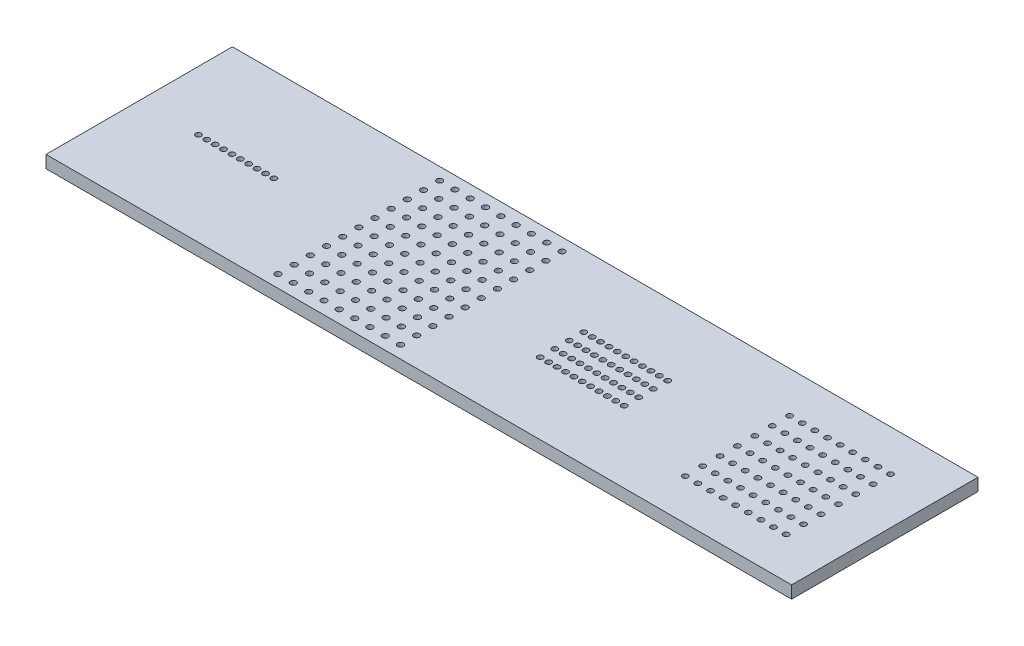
from build123d import *

# Parameters (mm, degrees)
ESQUISSE2_W                     = 120
ESQUISSE2_H                     = 30
BOSS_EXTRU_1_DEPTH              = 2
ENL_V_MAT_EXTRU_3_REACH         = 63.879
ESQUISSE8_R                     = 0.45
R_P_TITION_LIN_AIRE4_COUNT      = 10
R_P_TITION_LIN_AIRE4_PITCH      = 1.35
ENL_V_MAT_EXTRU_4_REACH         = 63.879
ESQUISSE10_R                    = 0.475
R_P_TITION_LIN_AIRE5_COUNT      = 9
R_P_TITION_LIN_AIRE5_PITCH      = 2.464
R_P_TITION_LIN_AIRE5_COUNT_DIR2 = 11
R_P_TITION_LIN_AIRE5_PITCH_DIR2 = 2.6
ENL_V_MAT_EXTRU_5_REACH         = 63.879
ESQUISSE12_R                    = 0.45
R_P_TITION_LIN_AIRE6_COUNT      = 11
R_P_TITION_LIN_AIRE6_PITCH      = 1.35
R_P_TITION_LIN_AIRE6_COUNT_DIR2 = 4
R_P_TITION_LIN_AIRE6_PITCH_DIR2 = 2.333
ENL_V_MAT_EXTRU_6_REACH         = 63.879
ESQUISSE14_R                    = 0.45
R_P_TITION_LIN_AIRE7_COUNT      = 9
R_P_TITION_LIN_AIRE7_PITCH      = 2.03
R_P_TITION_LIN_AIRE7_COUNT_DIR2 = 7
R_P_TITION_LIN_AIRE7_PITCH_DIR2 = 2.8


with BuildPart() as part:
    # Esquisse2 → Boss.-Extru.1 (new body)
    with BuildSketch(Plane(origin=(0, 0, 0), x_dir=(1, 0, 0), z_dir=(0, 1, 0))):
        Rectangle(ESQUISSE2_W, ESQUISSE2_H)
    extrude(amount=BOSS_EXTRU_1_DEPTH)

    # Esquisse8 → Enl_v. mat.-Extru.3 (cut, up to next)
    with BuildSketch(Plane(origin=(0, 2, 0), x_dir=(1, 0, 0), z_dir=(0, 1, 0)), mode=Mode.PRIVATE) as enl_v_mat_extru_3_sk1:
        with Locations(Location((-50.475, 0, 0), (0, 0, 270))):
            Circle(ESQUISSE8_R)
    enl_v_mat_extru_3_tool1 = extrude(enl_v_mat_extru_3_sk1.sketch, amount=-ENL_V_MAT_EXTRU_3_REACH, mode=Mode.PRIVATE) & part.part
    enl_v_mat_extru_3 = enl_v_mat_extru_3_tool1.solids().sort_by_distance((-50.475, 2, 0))[0]
    add(enl_v_mat_extru_3, mode=Mode.SUBTRACT)

    # R_p_tition lin_aire4: Enl_v. mat.-Extru.3 ×10
    with Locations(*[(i * R_P_TITION_LIN_AIRE4_PITCH, 0, 0) for i in range(1, R_P_TITION_LIN_AIRE4_COUNT)]):
        add(enl_v_mat_extru_3, mode=Mode.SUBTRACT)

    # Esquisse10 → Enl_v. mat.-Extru.4 (cut, up to next)
    with BuildSketch(Plane(origin=(0, 2, 0), x_dir=(1, 0, 0), z_dir=(0, 1, 0)), mode=Mode.PRIVATE) as enl_v_mat_extru_4_sk1:
        with Locations(Location((-24.656, 13, 0), (0, 0, 270))):
            Circle(ESQUISSE10_R)
    enl_v_mat_extru_4_tool1 = extrude(enl_v_mat_extru_4_sk1.sketch, amount=-ENL_V_MAT_EXTRU_4_REACH, mode=Mode.PRIVATE) & part.part
    enl_v_mat_extru_4 = enl_v_mat_extru_4_tool1.solids().sort_by_distance((-24.656, 2, -13))[0]
    add(enl_v_mat_extru_4, mode=Mode.SUBTRACT)

    # R_p_tition lin_aire5: Enl_v. mat.-Extru.4 9 × 11
    with Locations(*[(i * R_P_TITION_LIN_AIRE5_PITCH, 0, j * R_P_TITION_LIN_AIRE5_PITCH_DIR2) for i in range(R_P_TITION_LIN_AIRE5_COUNT) for j in range(R_P_TITION_LIN_AIRE5_COUNT_DIR2) if (i, j) != (0, 0)]):
        add(enl_v_mat_extru_4, mode=Mode.SUBTRACT)

    # Esquisse12 → Enl_v. mat.-Extru.5 (cut, up to next)
    with BuildSketch(Plane(origin=(0, 2, 0), x_dir=(1, 0, 0), z_dir=(0, 1, 0)), mode=Mode.PRIVATE) as enl_v_mat_extru_5_sk1:
        with Locations(Location((8.05, 3.4995, 0), (0, 0, 270))):
            Circle(ESQUISSE12_R)
    enl_v_mat_extru_5_tool1 = extrude(enl_v_mat_extru_5_sk1.sketch, amount=-ENL_V_MAT_EXTRU_5_REACH, mode=Mode.PRIVATE) & part.part
    enl_v_mat_extru_5 = enl_v_mat_extru_5_tool1.solids().sort_by_distance((8.05, 2, -3.4995))[0]
    add(enl_v_mat_extru_5, mode=Mode.SUBTRACT)

    # R_p_tition lin_aire6: Enl_v. mat.-Extru.5 11 × 4
    with Locations(*[(i * R_P_TITION_LIN_AIRE6_PITCH, 0, j * R_P_TITION_LIN_AIRE6_PITCH_DIR2) for i in range(R_P_TITION_LIN_AIRE6_COUNT) for j in range(R_P_TITION_LIN_AIRE6_COUNT_DIR2) if (i, j) != (0, 0)]):
        add(enl_v_mat_extru_5, mode=Mode.SUBTRACT)

    # Esquisse14 → Enl_v. mat.-Extru.6 (cut, up to next)
    with BuildSketch(Plane(origin=(0, 2, 0), x_dir=(1, 0, 0), z_dir=(0, 1, 0)), mode=Mode.PRIVATE) as enl_v_mat_extru_6_sk1:
        with Locations(Location((36.28, 8.4, 0), (0, 0, 270))):
            Circle(ESQUISSE14_R)
    enl_v_mat_extru_6_tool1 = extrude(enl_v_mat_extru_6_sk1.sketch, amount=-ENL_V_MAT_EXTRU_6_REACH, mode=Mode.PRIVATE) & part.part
    enl_v_mat_extru_6 = enl_v_mat_extru_6_tool1.solids().sort_by_distance((36.28, 2, -8.4))[0]
    add(enl_v_mat_extru_6, mode=Mode.SUBTRACT)

    # R_p_tition lin_aire7: Enl_v. mat.-Extru.6 9 × 7
    with Locations(*[(i * R_P_TITION_LIN_AIRE7_PITCH, 0, j * R_P_TITION_LIN_AIRE7_PITCH_DIR2) for i in range(R_P_TITION_LIN_AIRE7_COUNT) for j in range(R_P_TITION_LIN_AIRE7_COUNT_DIR2) if (i, j) != (0, 0)]):
        add(enl_v_mat_extru_6, mode=Mode.SUBTRACT)


solid = part.part
